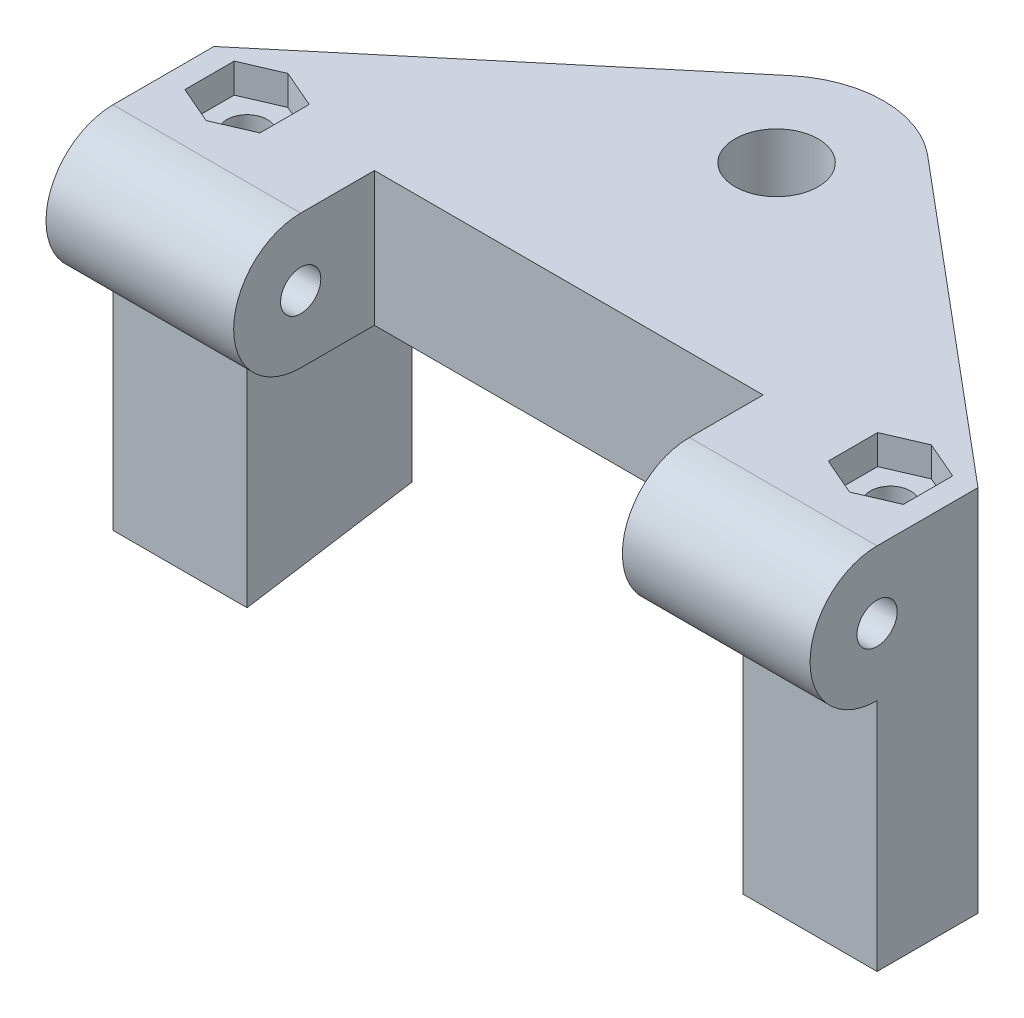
ISO-10303-21;
HEADER;
FILE_DESCRIPTION(('STEP AP214'),'2;1');
FILE_NAME('part.step','',(''),(''),'','','');
FILE_SCHEMA(('AUTOMOTIVE_DESIGN { 1 0 10303 214 1 1 1 1 }'));
ENDSEC;
DATA;
#1=APPLICATION_CONTEXT('core data for automotive mechanical design processes');
#2=APPLICATION_PROTOCOL_DEFINITION('international standard','automotive_design',2000,#1);
#3=PRODUCT_CONTEXT('',#1,'mechanical');
#4=PRODUCT('Part','Part','',(#3));
#5=PRODUCT_RELATED_PRODUCT_CATEGORY('part','',(#4));
#6=PRODUCT_DEFINITION_FORMATION('','',#4);
#7=PRODUCT_DEFINITION_CONTEXT('part definition',#1,'design');
#8=PRODUCT_DEFINITION('design','',#6,#7);
#9=PRODUCT_DEFINITION_SHAPE('','',#8);
#10=(LENGTH_UNIT() NAMED_UNIT(*) SI_UNIT(.MILLI.,.METRE.));
#11=(NAMED_UNIT(*) PLANE_ANGLE_UNIT() SI_UNIT($,.RADIAN.));
#12=(NAMED_UNIT(*) SI_UNIT($,.STERADIAN.) SOLID_ANGLE_UNIT());
#13=UNCERTAINTY_MEASURE_WITH_UNIT(LENGTH_MEASURE(1.E-05),#10,'distance_accuracy_value','');
#14=(GEOMETRIC_REPRESENTATION_CONTEXT(3) GLOBAL_UNCERTAINTY_ASSIGNED_CONTEXT((#13)) GLOBAL_UNIT_ASSIGNED_CONTEXT((#10,
#11,#12)) REPRESENTATION_CONTEXT('',''));
#15=CARTESIAN_POINT('',(0.,0.,0.));
#16=DIRECTION('',(0.,0.,1.));
#17=DIRECTION('',(1.,0.,0.));
#18=AXIS2_PLACEMENT_3D('',#15,#16,#17);
#19=CARTESIAN_POINT('',(26.0755319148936,-11.9595744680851,9.));
#20=DIRECTION('',(0.,1.,0.));
#21=DIRECTION('',(-1.,0.,0.));
#22=AXIS2_PLACEMENT_3D('',#19,#20,#21);
#23=CYLINDRICAL_SURFACE('',#22,1.49999999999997);
#24=CARTESIAN_POINT('',(26.0755319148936,-11.9595744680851,9.));
#25=DIRECTION('',(0.,-1.,0.));
#26=DIRECTION('',(1.,0.,0.));
#27=AXIS2_PLACEMENT_3D('',#24,#25,#26);
#28=CIRCLE('',#27,1.49999999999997);
#29=CARTESIAN_POINT('',(27.5755319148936,-11.9595744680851,9.));
#30=VERTEX_POINT('',#29);
#31=EDGE_CURVE('E268',#30,#30,#28,.T.);
#32=ORIENTED_EDGE('',*,*,#31,.T.);
#33=EDGE_LOOP('',(#32));
#34=FACE_BOUND('',#33,.T.);
#35=CARTESIAN_POINT('',(26.0755319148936,13.3404255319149,9.));
#36=DIRECTION('',(0.,-1.,0.));
#37=DIRECTION('',(1.,0.,0.));
#38=AXIS2_PLACEMENT_3D('',#35,#36,#37);
#39=CIRCLE('',#38,1.49999999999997);
#40=CARTESIAN_POINT('',(27.5755319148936,13.3404255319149,9.));
#41=VERTEX_POINT('',#40);
#42=EDGE_CURVE('E239',#41,#41,#39,.T.);
#43=ORIENTED_EDGE('',*,*,#42,.F.);
#44=EDGE_LOOP('',(#43));
#45=FACE_BOUND('',#44,.T.);
#46=ADVANCED_FACE('F39',(#34,#45),#23,.F.);
#47=CARTESIAN_POINT('',(-26.4244680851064,15.5404255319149,9.));
#48=DIRECTION('',(0.,-1.,0.));
#49=DIRECTION('',(1.,0.,0.));
#50=AXIS2_PLACEMENT_3D('',#47,#48,#49);
#51=PLANE('',#50);
#52=DIRECTION('',(-0.918032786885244,0.,0.396504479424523));
#53=VECTOR('',#52,1.);
#54=CARTESIAN_POINT('',(9.76376113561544,15.5404255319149,12.9951625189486));
#55=LINE('',#54,#53);
#56=CARTESIAN_POINT('',(26.0755319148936,15.5404255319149,5.95000000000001));
#57=VERTEX_POINT('',#56);
#58=CARTESIAN_POINT('',(23.2755319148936,15.5404255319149,7.1593386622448));
#59=VERTEX_POINT('',#58);
#60=EDGE_CURVE('E253',#57,#59,#55,.T.);
#61=ORIENTED_EDGE('',*,*,#60,.F.);
#62=DIRECTION('',(-0.918032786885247,0.,-0.396504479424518));
#63=VECTOR('',#62,1.);
#64=CARTESIAN_POINT('',(5.43211219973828,15.5404255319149,-2.96603056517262));
#65=LINE('',#64,#63);
#66=CARTESIAN_POINT('',(28.8755319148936,15.5404255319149,7.15933866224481));
#67=VERTEX_POINT('',#66);
#68=EDGE_CURVE('E54',#67,#57,#65,.T.);
#69=ORIENTED_EDGE('',*,*,#68,.F.);
#70=DIRECTION('',(0.,0.,1.));
#71=VECTOR('',#70,1.);
#72=CARTESIAN_POINT('',(28.8755319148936,15.5404255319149,0.));
#73=LINE('',#72,#71);
#74=CARTESIAN_POINT('',(28.8755319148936,15.5404255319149,10.8406613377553));
#75=VERTEX_POINT('',#74);
#76=EDGE_CURVE('E242',#67,#75,#73,.T.);
#77=ORIENTED_EDGE('',*,*,#76,.T.);
#78=DIRECTION('',(-0.918032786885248,0.,0.396504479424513));
#79=VECTOR('',#78,1.);
#80=CARTESIAN_POINT('',(11.9841862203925,15.5404255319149,18.1361461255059));
#81=LINE('',#80,#79);
#82=CARTESIAN_POINT('',(26.0755319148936,15.5404255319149,12.0500000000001));
#83=VERTEX_POINT('',#82);
#84=EDGE_CURVE('E261',#75,#83,#81,.T.);
#85=ORIENTED_EDGE('',*,*,#84,.T.);
#86=DIRECTION('',(-0.918032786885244,0.,-0.396504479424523));
#87=VECTOR('',#86,1.);
#88=CARTESIAN_POINT('',(3.21168711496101,15.5404255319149,2.17495304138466));
#89=LINE('',#88,#87);
#90=CARTESIAN_POINT('',(23.2755319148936,15.5404255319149,10.8406613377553));
#91=VERTEX_POINT('',#90);
#92=EDGE_CURVE('E258',#83,#91,#89,.T.);
#93=ORIENTED_EDGE('',*,*,#92,.T.);
#94=DIRECTION('',(0.,0.,1.));
#95=VECTOR('',#94,1.);
#96=CARTESIAN_POINT('',(23.2755319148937,15.5404255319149,1.44190191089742E-13));
#97=LINE('',#96,#95);
#98=EDGE_CURVE('E255',#59,#91,#97,.T.);
#99=ORIENTED_EDGE('',*,*,#98,.F.);
#100=EDGE_LOOP('',(#61,#69,#77,#85,#93,#99));
#101=FACE_BOUND('',#100,.T.);
#102=DIRECTION('',(0.,0.,-1.));
#103=VECTOR('',#102,1.);
#104=CARTESIAN_POINT('',(30.5755319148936,15.5404255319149,9.));
#105=LINE('',#104,#103);
#106=CARTESIAN_POINT('',(30.5755319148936,15.5404255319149,14.5));
#107=VERTEX_POINT('',#106);
#108=CARTESIAN_POINT('',(30.5755319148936,15.5404255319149,6.97108117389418));
#109=VERTEX_POINT('',#108);
#110=EDGE_CURVE('E381',#107,#109,#105,.T.);
#111=ORIENTED_EDGE('',*,*,#110,.T.);
#112=DIRECTION('',(0.766044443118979,0.,0.642787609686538));
#113=VECTOR('',#112,1.);
#114=CARTESIAN_POINT('',(9.20048586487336,15.5404255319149,-10.9647120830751));
#115=LINE('',#114,#113);
#116=CARTESIAN_POINT('',(7.21783279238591,15.5404255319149,-12.6283555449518));
#117=VERTEX_POINT('',#116);
#118=EDGE_CURVE('E353',#117,#109,#115,.T.);
#119=ORIENTED_EDGE('',*,*,#118,.F.);
#120=CARTESIAN_POINT('',(2.07553191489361,15.5404255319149,-6.49999999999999));
#121=DIRECTION('',(0.,1.,0.));
#122=DIRECTION('',(-1.,0.,0.));
#123=AXIS2_PLACEMENT_3D('',#120,#121,#122);
#124=CIRCLE('',#123,8.);
#125=CARTESIAN_POINT('',(-3.0667689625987,15.5404255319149,-12.6283555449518));
#126=VERTEX_POINT('',#125);
#127=EDGE_CURVE('E370',#117,#126,#124,.T.);
#128=ORIENTED_EDGE('',*,*,#127,.T.);
#129=DIRECTION('',(-0.766044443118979,0.,0.642787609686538));
#130=VECTOR('',#129,1.);
#131=CARTESIAN_POINT('',(-7.48536628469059,15.5404255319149,-8.92071216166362));
#132=LINE('',#131,#130);
#133=CARTESIAN_POINT('',(-26.4244680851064,15.5404255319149,6.97108117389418));
#134=VERTEX_POINT('',#133);
#135=EDGE_CURVE('E373',#126,#134,#132,.T.);
#136=ORIENTED_EDGE('',*,*,#135,.T.);
#137=DIRECTION('',(0.,0.,-1.));
#138=VECTOR('',#137,1.);
#139=CARTESIAN_POINT('',(-26.4244680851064,15.5404255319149,9.));
#140=LINE('',#139,#138);
#141=CARTESIAN_POINT('',(-26.4244680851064,15.5404255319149,14.5));
#142=VERTEX_POINT('',#141);
#143=EDGE_CURVE('E386',#142,#134,#140,.T.);
#144=ORIENTED_EDGE('',*,*,#143,.F.);
#145=DIRECTION('',(-1.,0.,0.));
#146=VECTOR('',#145,1.);
#147=CARTESIAN_POINT('',(-12.4244680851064,15.5404255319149,14.5));
#148=LINE('',#147,#146);
#149=CARTESIAN_POINT('',(-12.4244680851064,15.5404255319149,14.5));
#150=VERTEX_POINT('',#149);
#151=EDGE_CURVE('E401',#150,#142,#148,.T.);
#152=ORIENTED_EDGE('',*,*,#151,.F.);
#153=DIRECTION('',(0.,0.,1.));
#154=VECTOR('',#153,1.);
#155=CARTESIAN_POINT('',(-12.4244680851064,15.5404255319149,0.));
#156=LINE('',#155,#154);
#157=CARTESIAN_POINT('',(-12.4244680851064,15.5404255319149,9.));
#158=VERTEX_POINT('',#157);
#159=EDGE_CURVE('E415',#158,#150,#156,.T.);
#160=ORIENTED_EDGE('',*,*,#159,.F.);
#161=DIRECTION('',(-1.,0.,0.));
#162=VECTOR('',#161,1.);
#163=CARTESIAN_POINT('',(-26.4244680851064,15.5404255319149,9.));
#164=LINE('',#163,#162);
#165=CARTESIAN_POINT('',(16.5755319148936,15.5404255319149,9.));
#166=VERTEX_POINT('',#165);
#167=EDGE_CURVE('E390',#166,#158,#164,.T.);
#168=ORIENTED_EDGE('',*,*,#167,.F.);
#169=DIRECTION('',(0.,0.,1.));
#170=VECTOR('',#169,1.);
#171=CARTESIAN_POINT('',(16.5755319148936,15.5404255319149,0.));
#172=LINE('',#171,#170);
#173=CARTESIAN_POINT('',(16.5755319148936,15.5404255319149,14.5));
#174=VERTEX_POINT('',#173);
#175=EDGE_CURVE('E392',#166,#174,#172,.T.);
#176=ORIENTED_EDGE('',*,*,#175,.T.);
#177=DIRECTION('',(1.,0.,0.));
#178=VECTOR('',#177,1.);
#179=CARTESIAN_POINT('',(16.5755319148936,15.5404255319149,14.5));
#180=LINE('',#179,#178);
#181=EDGE_CURVE('E385',#174,#107,#180,.T.);
#182=ORIENTED_EDGE('',*,*,#181,.T.);
#183=EDGE_LOOP('',(#111,#119,#128,#136,#144,#152,#160,#168,#176,#182));
#184=FACE_BOUND('',#183,.T.);
#185=CARTESIAN_POINT('',(2.07553191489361,15.5404255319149,-6.49999999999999));
#186=DIRECTION('',(0.,1.,0.));
#187=DIRECTION('',(-1.,0.,0.));
#188=AXIS2_PLACEMENT_3D('',#185,#186,#187);
#189=CIRCLE('',#188,3.1);
#190=CARTESIAN_POINT('',(-1.02446808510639,15.5404255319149,-6.49999999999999));
#191=VERTEX_POINT('',#190);
#192=EDGE_CURVE('E360',#191,#191,#189,.T.);
#193=ORIENTED_EDGE('',*,*,#192,.F.);
#194=EDGE_LOOP('',(#193));
#195=FACE_BOUND('',#194,.T.);
#196=DIRECTION('',(0.918032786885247,0.,-0.396504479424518));
#197=VECTOR('',#196,1.);
#198=CARTESIAN_POINT('',(-1.28104836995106,15.5404255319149,-2.96603056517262));
#199=LINE('',#198,#197);
#200=CARTESIAN_POINT('',(-24.7244680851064,15.5404255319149,7.15933866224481));
#201=VERTEX_POINT('',#200);
#202=CARTESIAN_POINT('',(-21.9244680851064,15.5404255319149,5.95000000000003));
#203=VERTEX_POINT('',#202);
#204=EDGE_CURVE('E62',#201,#203,#199,.T.);
#205=ORIENTED_EDGE('',*,*,#204,.T.);
#206=DIRECTION('',(0.918032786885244,0.,0.396504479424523));
#207=VECTOR('',#206,1.);
#208=CARTESIAN_POINT('',(-5.61269730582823,15.5404255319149,12.9951625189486));
#209=LINE('',#208,#207);
#210=CARTESIAN_POINT('',(-19.1244680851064,15.5404255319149,7.1593386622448));
#211=VERTEX_POINT('',#210);
#212=EDGE_CURVE('E284',#203,#211,#209,.T.);
#213=ORIENTED_EDGE('',*,*,#212,.T.);
#214=DIRECTION('',(0.,0.,1.));
#215=VECTOR('',#214,1.);
#216=CARTESIAN_POINT('',(-19.1244680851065,15.5404255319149,1.44190191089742E-13));
#217=LINE('',#216,#215);
#218=CARTESIAN_POINT('',(-19.1244680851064,15.5404255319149,10.8406613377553));
#219=VERTEX_POINT('',#218);
#220=EDGE_CURVE('E311',#211,#219,#217,.T.);
#221=ORIENTED_EDGE('',*,*,#220,.T.);
#222=DIRECTION('',(0.918032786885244,0.,-0.396504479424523));
#223=VECTOR('',#222,1.);
#224=CARTESIAN_POINT('',(0.939376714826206,15.5404255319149,2.17495304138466));
#225=LINE('',#224,#223);
#226=CARTESIAN_POINT('',(-21.9244680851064,15.5404255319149,12.0500000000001));
#227=VERTEX_POINT('',#226);
#228=EDGE_CURVE('E308',#227,#219,#225,.T.);
#229=ORIENTED_EDGE('',*,*,#228,.F.);
#230=DIRECTION('',(0.918032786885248,0.,0.396504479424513));
#231=VECTOR('',#230,1.);
#232=CARTESIAN_POINT('',(-7.83312239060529,15.5404255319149,18.1361461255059));
#233=LINE('',#232,#231);
#234=CARTESIAN_POINT('',(-24.7244680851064,15.5404255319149,10.8406613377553));
#235=VERTEX_POINT('',#234);
#236=EDGE_CURVE('E305',#235,#227,#233,.T.);
#237=ORIENTED_EDGE('',*,*,#236,.F.);
#238=DIRECTION('',(0.,0.,1.));
#239=VECTOR('',#238,1.);
#240=CARTESIAN_POINT('',(-24.7244680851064,15.5404255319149,0.));
#241=LINE('',#240,#239);
#242=EDGE_CURVE('E302',#201,#235,#241,.T.);
#243=ORIENTED_EDGE('',*,*,#242,.F.);
#244=EDGE_LOOP('',(#205,#213,#221,#229,#237,#243));
#245=FACE_BOUND('',#244,.T.);
#246=ADVANCED_FACE('F494',(#101,#184,#195,#245),#51,.F.);
#247=CARTESIAN_POINT('',(-21.9244680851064,-11.9595744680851,9.));
#248=DIRECTION('',(0.,1.,0.));
#249=DIRECTION('',(-1.,0.,0.));
#250=AXIS2_PLACEMENT_3D('',#247,#248,#249);
#251=CYLINDRICAL_SURFACE('',#250,1.49999999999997);
#252=CARTESIAN_POINT('',(-21.9244680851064,-11.9595744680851,9.));
#253=DIRECTION('',(0.,1.,0.));
#254=DIRECTION('',(-1.,0.,0.));
#255=AXIS2_PLACEMENT_3D('',#252,#253,#254);
#256=CIRCLE('',#255,1.49999999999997);
#257=CARTESIAN_POINT('',(-23.4244680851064,-11.9595744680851,9.));
#258=VERTEX_POINT('',#257);
#259=EDGE_CURVE('E318',#258,#258,#256,.T.);
#260=ORIENTED_EDGE('',*,*,#259,.F.);
#261=EDGE_LOOP('',(#260));
#262=FACE_BOUND('',#261,.T.);
#263=CARTESIAN_POINT('',(-21.9244680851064,13.3404255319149,9.));
#264=DIRECTION('',(0.,1.,0.));
#265=DIRECTION('',(-1.,0.,0.));
#266=AXIS2_PLACEMENT_3D('',#263,#264,#265);
#267=CIRCLE('',#266,1.49999999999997);
#268=CARTESIAN_POINT('',(-23.4244680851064,13.3404255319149,9.));
#269=VERTEX_POINT('',#268);
#270=EDGE_CURVE('E280',#269,#269,#267,.T.);
#271=ORIENTED_EDGE('',*,*,#270,.T.);
#272=EDGE_LOOP('',(#271));
#273=FACE_BOUND('',#272,.T.);
#274=ADVANCED_FACE('F554',(#262,#273),#251,.F.);
#275=CARTESIAN_POINT('',(0.,-11.9595744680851,0.));
#276=DIRECTION('',(0.,-1.,0.));
#277=DIRECTION('',(0.,0.,-1.));
#278=AXIS2_PLACEMENT_3D('',#275,#276,#277);
#279=PLANE('',#278);
#280=ORIENTED_EDGE('',*,*,#259,.T.);
#281=EDGE_LOOP('',(#280));
#282=FACE_BOUND('',#281,.T.);
#283=DIRECTION('',(-0.766044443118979,0.,0.642787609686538));
#284=VECTOR('',#283,1.);
#285=CARTESIAN_POINT('',(-7.48536628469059,-11.9595744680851,-8.92071216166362));
#286=LINE('',#285,#284);
#287=CARTESIAN_POINT('',(-18.3925381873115,-11.9595744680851,0.231491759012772));
#288=VERTEX_POINT('',#287);
#289=CARTESIAN_POINT('',(-26.4244680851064,-11.9595744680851,6.97108117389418));
#290=VERTEX_POINT('',#289);
#291=EDGE_CURVE('E333',#288,#290,#286,.T.);
#292=ORIENTED_EDGE('',*,*,#291,.F.);
#293=DIRECTION('',(0.136637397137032,0.,0.990621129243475));
#294=VECTOR('',#293,1.);
#295=CARTESIAN_POINT('',(-18.0804873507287,-11.9595744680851,2.49386032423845));
#296=LINE('',#295,#294);
#297=CARTESIAN_POINT('',(-16.4244680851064,-11.9595744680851,14.5));
#298=VERTEX_POINT('',#297);
#299=EDGE_CURVE('E330',#288,#298,#296,.T.);
#300=ORIENTED_EDGE('',*,*,#299,.T.);
#301=DIRECTION('',(-1.,0.,0.));
#302=VECTOR('',#301,1.);
#303=CARTESIAN_POINT('',(-12.4244680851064,-11.9595744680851,14.5));
#304=LINE('',#303,#302);
#305=CARTESIAN_POINT('',(-26.4244680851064,-11.9595744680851,14.5));
#306=VERTEX_POINT('',#305);
#307=EDGE_CURVE('E47',#298,#306,#304,.T.);
#308=ORIENTED_EDGE('',*,*,#307,.T.);
#309=DIRECTION('',(0.,0.,-1.));
#310=VECTOR('',#309,1.);
#311=CARTESIAN_POINT('',(-26.4244680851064,-11.9595744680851,14.5));
#312=LINE('',#311,#310);
#313=EDGE_CURVE('E11',#306,#290,#312,.T.);
#314=ORIENTED_EDGE('',*,*,#313,.T.);
#315=EDGE_LOOP('',(#292,#300,#308,#314));
#316=FACE_BOUND('',#315,.T.);
#317=ADVANCED_FACE('F526',(#282,#316),#279,.T.);
#318=ORIENTED_EDGE('',*,*,#31,.F.);
#319=EDGE_LOOP('',(#318));
#320=FACE_BOUND('',#319,.T.);
#321=DIRECTION('',(-1.,0.,0.));
#322=VECTOR('',#321,1.);
#323=CARTESIAN_POINT('',(30.5755319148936,-11.9595744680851,14.5));
#324=LINE('',#323,#322);
#325=CARTESIAN_POINT('',(30.5755319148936,-11.9595744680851,14.5));
#326=VERTEX_POINT('',#325);
#327=CARTESIAN_POINT('',(20.5755319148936,-11.9595744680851,14.5));
#328=VERTEX_POINT('',#327);
#329=EDGE_CURVE('E460',#326,#328,#324,.T.);
#330=ORIENTED_EDGE('',*,*,#329,.T.);
#331=DIRECTION('',(0.136637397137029,0.,-0.990621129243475));
#332=VECTOR('',#331,1.);
#333=CARTESIAN_POINT('',(22.1540517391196,-11.9595744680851,3.05573127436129));
#334=LINE('',#333,#332);
#335=CARTESIAN_POINT('',(22.5436020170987,-11.9595744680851,0.231491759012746));
#336=VERTEX_POINT('',#335);
#337=EDGE_CURVE('E335',#328,#336,#334,.T.);
#338=ORIENTED_EDGE('',*,*,#337,.T.);
#339=DIRECTION('',(0.766044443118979,0.,0.642787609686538));
#340=VECTOR('',#339,1.);
#341=CARTESIAN_POINT('',(9.20048586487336,-11.9595744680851,-10.9647120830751));
#342=LINE('',#341,#340);
#343=CARTESIAN_POINT('',(30.5755319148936,-11.9595744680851,6.97108117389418));
#344=VERTEX_POINT('',#343);
#345=EDGE_CURVE('E347',#336,#344,#342,.T.);
#346=ORIENTED_EDGE('',*,*,#345,.T.);
#347=DIRECTION('',(0.,0.,1.));
#348=VECTOR('',#347,1.);
#349=CARTESIAN_POINT('',(30.5755319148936,-11.9595744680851,0.));
#350=LINE('',#349,#348);
#351=EDGE_CURVE('E440',#344,#326,#350,.T.);
#352=ORIENTED_EDGE('',*,*,#351,.T.);
#353=EDGE_LOOP('',(#330,#338,#346,#352));
#354=FACE_BOUND('',#353,.T.);
#355=ADVANCED_FACE('F465',(#320,#354),#279,.T.);
#356=CARTESIAN_POINT('',(9.20048586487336,5.54042553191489,-10.9647120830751));
#357=DIRECTION('',(-0.642787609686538,0.,0.766044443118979));
#358=DIRECTION('',(0.766044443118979,0.,0.642787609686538));
#359=AXIS2_PLACEMENT_3D('',#356,#357,#358);
#360=PLANE('',#359);
#361=DIRECTION('',(0.,-1.,0.));
#362=VECTOR('',#361,1.);
#363=CARTESIAN_POINT('',(22.5436020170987,20.1733780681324,0.231491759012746));
#364=LINE('',#363,#362);
#365=CARTESIAN_POINT('',(22.5436020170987,5.54042553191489,0.231491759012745));
#366=VERTEX_POINT('',#365);
#367=EDGE_CURVE('E334',#366,#336,#364,.T.);
#368=ORIENTED_EDGE('',*,*,#367,.F.);
#369=DIRECTION('',(0.766044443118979,0.,0.642787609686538));
#370=VECTOR('',#369,1.);
#371=CARTESIAN_POINT('',(9.20048586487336,5.54042553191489,-10.9647120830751));
#372=LINE('',#371,#370);
#373=CARTESIAN_POINT('',(7.21783279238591,5.54042553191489,-12.6283555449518));
#374=VERTEX_POINT('',#373);
#375=EDGE_CURVE('E357',#374,#366,#372,.T.);
#376=ORIENTED_EDGE('',*,*,#375,.F.);
#377=DIRECTION('',(0.,1.,0.));
#378=VECTOR('',#377,1.);
#379=CARTESIAN_POINT('',(7.21783279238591,5.54042553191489,-12.6283555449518));
#380=LINE('',#379,#378);
#381=EDGE_CURVE('E368',#374,#117,#380,.T.);
#382=ORIENTED_EDGE('',*,*,#381,.T.);
#383=ORIENTED_EDGE('',*,*,#118,.T.);
#384=DIRECTION('',(0.,1.,0.));
#385=VECTOR('',#384,1.);
#386=CARTESIAN_POINT('',(30.5755319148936,-11.9595744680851,6.97108117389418));
#387=LINE('',#386,#385);
#388=EDGE_CURVE('E349',#344,#109,#387,.T.);
#389=ORIENTED_EDGE('',*,*,#388,.F.);
#390=ORIENTED_EDGE('',*,*,#345,.F.);
#391=EDGE_LOOP('',(#368,#376,#382,#383,#389,#390));
#392=FACE_BOUND('',#391,.T.);
#393=ADVANCED_FACE('F491',(#392),#360,.F.);
#394=CARTESIAN_POINT('',(-7.48536628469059,5.54042553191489,-8.92071216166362));
#395=DIRECTION('',(-0.642787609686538,0.,-0.766044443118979));
#396=DIRECTION('',(-0.766044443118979,0.,0.642787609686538));
#397=AXIS2_PLACEMENT_3D('',#394,#395,#396);
#398=PLANE('',#397);
#399=DIRECTION('',(-0.766044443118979,0.,0.642787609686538));
#400=VECTOR('',#399,1.);
#401=CARTESIAN_POINT('',(-7.48536628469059,5.54042553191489,-8.92071216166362));
#402=LINE('',#401,#400);
#403=CARTESIAN_POINT('',(-3.0667689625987,5.54042553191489,-12.6283555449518));
#404=VERTEX_POINT('',#403);
#405=CARTESIAN_POINT('',(-18.3925381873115,5.54042553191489,0.231491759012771));
#406=VERTEX_POINT('',#405);
#407=EDGE_CURVE('E363',#404,#406,#402,.T.);
#408=ORIENTED_EDGE('',*,*,#407,.T.);
#409=DIRECTION('',(0.,-1.,0.));
#410=VECTOR('',#409,1.);
#411=CARTESIAN_POINT('',(-18.3925381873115,20.1733780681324,0.231491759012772));
#412=LINE('',#411,#410);
#413=EDGE_CURVE('E342',#406,#288,#412,.T.);
#414=ORIENTED_EDGE('',*,*,#413,.T.);
#415=ORIENTED_EDGE('',*,*,#291,.T.);
#416=DIRECTION('',(0.,1.,0.));
#417=VECTOR('',#416,1.);
#418=CARTESIAN_POINT('',(-26.4244680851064,-11.9595744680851,6.97108117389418));
#419=LINE('',#418,#417);
#420=EDGE_CURVE('E350',#290,#134,#419,.T.);
#421=ORIENTED_EDGE('',*,*,#420,.T.);
#422=ORIENTED_EDGE('',*,*,#135,.F.);
#423=DIRECTION('',(0.,1.,0.));
#424=VECTOR('',#423,1.);
#425=CARTESIAN_POINT('',(-3.0667689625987,5.54042553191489,-12.6283555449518));
#426=LINE('',#425,#424);
#427=EDGE_CURVE('E377',#404,#126,#426,.T.);
#428=ORIENTED_EDGE('',*,*,#427,.F.);
#429=EDGE_LOOP('',(#408,#414,#415,#421,#422,#428));
#430=FACE_BOUND('',#429,.T.);
#431=ADVANCED_FACE('F532',(#430),#398,.T.);
#432=CARTESIAN_POINT('',(-26.4244680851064,15.5404255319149,9.));
#433=DIRECTION('',(1.,0.,0.));
#434=DIRECTION('',(0.,1.,0.));
#435=AXIS2_PLACEMENT_3D('',#432,#433,#434);
#436=PLANE('',#435);
#437=CARTESIAN_POINT('',(-26.4244680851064,10.5404255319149,14.5));
#438=DIRECTION('',(-1.,0.,0.));
#439=DIRECTION('',(0.,-1.,0.));
#440=AXIS2_PLACEMENT_3D('',#437,#438,#439);
#441=CIRCLE('',#440,1.5);
#442=CARTESIAN_POINT('',(-26.4244680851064,9.04042553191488,14.5));
#443=VERTEX_POINT('',#442);
#444=EDGE_CURVE('E404',#443,#443,#441,.T.);
#445=ORIENTED_EDGE('',*,*,#444,.F.);
#446=EDGE_LOOP('',(#445));
#447=FACE_BOUND('',#446,.T.);
#448=ORIENTED_EDGE('',*,*,#420,.F.);
#449=ORIENTED_EDGE('',*,*,#313,.F.);
#450=DIRECTION('',(0.,-1.,0.));
#451=VECTOR('',#450,1.);
#452=CARTESIAN_POINT('',(-26.4244680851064,16.9531377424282,14.5));
#453=LINE('',#452,#451);
#454=CARTESIAN_POINT('',(-26.4244680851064,5.54042553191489,14.5));
#455=VERTEX_POINT('',#454);
#456=EDGE_CURVE('E447',#455,#306,#453,.T.);
#457=ORIENTED_EDGE('',*,*,#456,.F.);
#458=CARTESIAN_POINT('',(-26.4244680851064,10.5404255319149,14.5));
#459=DIRECTION('',(-1.,0.,0.));
#460=DIRECTION('',(0.,-1.,0.));
#461=AXIS2_PLACEMENT_3D('',#458,#459,#460);
#462=CIRCLE('',#461,5.);
#463=EDGE_CURVE('E379',#455,#142,#462,.T.);
#464=ORIENTED_EDGE('',*,*,#463,.T.);
#465=ORIENTED_EDGE('',*,*,#143,.T.);
#466=EDGE_LOOP('',(#448,#449,#457,#464,#465));
#467=FACE_BOUND('',#466,.T.);
#468=ADVANCED_FACE('F529',(#447,#467),#436,.F.);
#469=CARTESIAN_POINT('',(30.5755319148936,15.5404255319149,9.));
#470=DIRECTION('',(-1.,0.,0.));
#471=DIRECTION('',(0.,-1.,0.));
#472=AXIS2_PLACEMENT_3D('',#469,#470,#471);
#473=PLANE('',#472);
#474=CARTESIAN_POINT('',(30.5755319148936,10.5404255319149,14.5));
#475=DIRECTION('',(-1.,0.,0.));
#476=DIRECTION('',(0.,-1.,0.));
#477=AXIS2_PLACEMENT_3D('',#474,#475,#476);
#478=CIRCLE('',#477,1.5);
#479=CARTESIAN_POINT('',(30.5755319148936,9.04042553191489,14.5));
#480=VERTEX_POINT('',#479);
#481=EDGE_CURVE('E389',#480,#480,#478,.T.);
#482=ORIENTED_EDGE('',*,*,#481,.T.);
#483=EDGE_LOOP('',(#482));
#484=FACE_BOUND('',#483,.T.);
#485=ORIENTED_EDGE('',*,*,#351,.F.);
#486=ORIENTED_EDGE('',*,*,#388,.T.);
#487=ORIENTED_EDGE('',*,*,#110,.F.);
#488=CARTESIAN_POINT('',(30.5755319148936,10.5404255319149,14.5));
#489=DIRECTION('',(-1.,0.,0.));
#490=DIRECTION('',(0.,-1.,0.));
#491=AXIS2_PLACEMENT_3D('',#488,#489,#490);
#492=CIRCLE('',#491,5.);
#493=CARTESIAN_POINT('',(30.5755319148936,5.54042553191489,14.5));
#494=VERTEX_POINT('',#493);
#495=EDGE_CURVE('E414',#494,#107,#492,.T.);
#496=ORIENTED_EDGE('',*,*,#495,.F.);
#497=DIRECTION('',(0.,-1.,0.));
#498=VECTOR('',#497,1.);
#499=CARTESIAN_POINT('',(30.5755319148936,16.9531377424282,14.5));
#500=LINE('',#499,#498);
#501=EDGE_CURVE('E431',#494,#326,#500,.T.);
#502=ORIENTED_EDGE('',*,*,#501,.T.);
#503=EDGE_LOOP('',(#485,#486,#487,#496,#502));
#504=FACE_BOUND('',#503,.T.);
#505=ADVANCED_FACE('F41',(#484,#504),#473,.F.);
#506=CARTESIAN_POINT('',(0.,16.9531377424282,14.5));
#507=DIRECTION('',(0.,0.,1.));
#508=DIRECTION('',(1.,0.,0.));
#509=AXIS2_PLACEMENT_3D('',#506,#507,#508);
#510=PLANE('',#509);
#511=ORIENTED_EDGE('',*,*,#456,.T.);
#512=ORIENTED_EDGE('',*,*,#307,.F.);
#513=DIRECTION('',(0.,-1.,0.));
#514=VECTOR('',#513,1.);
#515=CARTESIAN_POINT('',(-16.4244680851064,16.9531377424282,14.5));
#516=LINE('',#515,#514);
#517=CARTESIAN_POINT('',(-16.4244680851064,5.54042553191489,14.5));
#518=VERTEX_POINT('',#517);
#519=EDGE_CURVE('E450',#518,#298,#516,.T.);
#520=ORIENTED_EDGE('',*,*,#519,.F.);
#521=DIRECTION('',(1.,0.,0.));
#522=VECTOR('',#521,1.);
#523=CARTESIAN_POINT('',(0.,5.54042553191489,14.5));
#524=LINE('',#523,#522);
#525=EDGE_CURVE('E384',#455,#518,#524,.T.);
#526=ORIENTED_EDGE('',*,*,#525,.F.);
#527=EDGE_LOOP('',(#511,#512,#520,#526));
#528=FACE_BOUND('',#527,.T.);
#529=ADVANCED_FACE('F521',(#528),#510,.T.);
#530=CARTESIAN_POINT('',(30.5755319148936,16.9531377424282,14.5));
#531=DIRECTION('',(0.,0.,1.));
#532=DIRECTION('',(1.,0.,0.));
#533=AXIS2_PLACEMENT_3D('',#530,#531,#532);
#534=PLANE('',#533);
#535=DIRECTION('',(0.,-1.,0.));
#536=VECTOR('',#535,1.);
#537=CARTESIAN_POINT('',(20.5755319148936,16.9531377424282,14.5));
#538=LINE('',#537,#536);
#539=CARTESIAN_POINT('',(20.5755319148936,5.54042553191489,14.5));
#540=VERTEX_POINT('',#539);
#541=EDGE_CURVE('E397',#540,#328,#538,.T.);
#542=ORIENTED_EDGE('',*,*,#541,.T.);
#543=ORIENTED_EDGE('',*,*,#329,.F.);
#544=ORIENTED_EDGE('',*,*,#501,.F.);
#545=DIRECTION('',(1.,0.,0.));
#546=VECTOR('',#545,1.);
#547=CARTESIAN_POINT('',(30.5755319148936,5.54042553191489,14.5));
#548=LINE('',#547,#546);
#549=EDGE_CURVE('E428',#540,#494,#548,.T.);
#550=ORIENTED_EDGE('',*,*,#549,.F.);
#551=EDGE_LOOP('',(#542,#543,#544,#550));
#552=FACE_BOUND('',#551,.T.);
#553=ADVANCED_FACE('F471',(#552),#534,.T.);
#554=CARTESIAN_POINT('',(-16.4244680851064,5.54042553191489,9.));
#555=DIRECTION('',(0.,-1.,0.));
#556=DIRECTION('',(0.,0.,-1.));
#557=AXIS2_PLACEMENT_3D('',#554,#555,#556);
#558=PLANE('',#557);
#559=DIRECTION('',(-0.136637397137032,0.,-0.990621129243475));
#560=VECTOR('',#559,1.);
#561=CARTESIAN_POINT('',(-18.0804873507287,5.54042553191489,2.49386032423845));
#562=LINE('',#561,#560);
#563=EDGE_CURVE('E338',#518,#406,#562,.T.);
#564=ORIENTED_EDGE('',*,*,#563,.T.);
#565=ORIENTED_EDGE('',*,*,#407,.F.);
#566=CARTESIAN_POINT('',(2.07553191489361,5.54042553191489,-6.49999999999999));
#567=DIRECTION('',(0.,1.,0.));
#568=DIRECTION('',(-1.,0.,0.));
#569=AXIS2_PLACEMENT_3D('',#566,#567,#568);
#570=CIRCLE('',#569,8.);
#571=EDGE_CURVE('E359',#374,#404,#570,.T.);
#572=ORIENTED_EDGE('',*,*,#571,.F.);
#573=ORIENTED_EDGE('',*,*,#375,.T.);
#574=DIRECTION('',(-0.136637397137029,0.,0.990621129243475));
#575=VECTOR('',#574,1.);
#576=CARTESIAN_POINT('',(22.1540517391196,5.54042553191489,3.05573127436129));
#577=LINE('',#576,#575);
#578=EDGE_CURVE('E331',#366,#540,#577,.T.);
#579=ORIENTED_EDGE('',*,*,#578,.T.);
#580=DIRECTION('',(1.,0.,0.));
#581=VECTOR('',#580,1.);
#582=CARTESIAN_POINT('',(16.5755319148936,5.54042553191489,14.5));
#583=LINE('',#582,#581);
#584=CARTESIAN_POINT('',(16.5755319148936,5.54042553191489,14.5));
#585=VERTEX_POINT('',#584);
#586=EDGE_CURVE('E425',#585,#540,#583,.T.);
#587=ORIENTED_EDGE('',*,*,#586,.F.);
#588=DIRECTION('',(0.,0.,1.));
#589=VECTOR('',#588,1.);
#590=CARTESIAN_POINT('',(16.5755319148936,5.54042553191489,0.));
#591=LINE('',#590,#589);
#592=CARTESIAN_POINT('',(16.5755319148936,5.54042553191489,9.));
#593=VERTEX_POINT('',#592);
#594=EDGE_CURVE('E437',#593,#585,#591,.T.);
#595=ORIENTED_EDGE('',*,*,#594,.F.);
#596=DIRECTION('',(-1.,0.,0.));
#597=VECTOR('',#596,1.);
#598=CARTESIAN_POINT('',(-16.4244680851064,5.54042553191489,9.));
#599=LINE('',#598,#597);
#600=CARTESIAN_POINT('',(-12.4244680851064,5.54042553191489,9.));
#601=VERTEX_POINT('',#600);
#602=EDGE_CURVE('E394',#593,#601,#599,.T.);
#603=ORIENTED_EDGE('',*,*,#602,.T.);
#604=DIRECTION('',(0.,0.,1.));
#605=VECTOR('',#604,1.);
#606=CARTESIAN_POINT('',(-12.4244680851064,5.54042553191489,0.));
#607=LINE('',#606,#605);
#608=CARTESIAN_POINT('',(-12.4244680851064,5.54042553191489,14.5));
#609=VERTEX_POINT('',#608);
#610=EDGE_CURVE('E396',#601,#609,#607,.T.);
#611=ORIENTED_EDGE('',*,*,#610,.T.);
#612=DIRECTION('',(-1.,0.,0.));
#613=VECTOR('',#612,1.);
#614=CARTESIAN_POINT('',(-12.4244680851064,5.54042553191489,14.5));
#615=LINE('',#614,#613);
#616=EDGE_CURVE('E398',#609,#518,#615,.T.);
#617=ORIENTED_EDGE('',*,*,#616,.T.);
#618=EDGE_LOOP('',(#564,#565,#572,#573,#579,#587,#595,#603,#611,#617));
#619=FACE_BOUND('',#618,.T.);
#620=CARTESIAN_POINT('',(2.07553191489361,5.54042553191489,-6.49999999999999));
#621=DIRECTION('',(0.,1.,0.));
#622=DIRECTION('',(-1.,0.,0.));
#623=AXIS2_PLACEMENT_3D('',#620,#621,#622);
#624=CIRCLE('',#623,3.1);
#625=CARTESIAN_POINT('',(-1.02446808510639,5.54042553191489,-6.49999999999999));
#626=VERTEX_POINT('',#625);
#627=EDGE_CURVE('E365',#626,#626,#624,.T.);
#628=ORIENTED_EDGE('',*,*,#627,.T.);
#629=EDGE_LOOP('',(#628));
#630=FACE_BOUND('',#629,.T.);
#631=ADVANCED_FACE('F481',(#619,#630),#558,.T.);
#632=CARTESIAN_POINT('',(0.,0.,9.));
#633=DIRECTION('',(0.,0.,1.));
#634=DIRECTION('',(1.,0.,0.));
#635=AXIS2_PLACEMENT_3D('',#632,#633,#634);
#636=PLANE('',#635);
#637=ORIENTED_EDGE('',*,*,#602,.F.);
#638=DIRECTION('',(0.,1.,0.));
#639=VECTOR('',#638,1.);
#640=CARTESIAN_POINT('',(16.5755319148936,0.,9.));
#641=LINE('',#640,#639);
#642=EDGE_CURVE('E393',#593,#166,#641,.T.);
#643=ORIENTED_EDGE('',*,*,#642,.T.);
#644=ORIENTED_EDGE('',*,*,#167,.T.);
#645=DIRECTION('',(0.,1.,0.));
#646=VECTOR('',#645,1.);
#647=CARTESIAN_POINT('',(-12.4244680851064,0.,9.));
#648=LINE('',#647,#646);
#649=EDGE_CURVE('E408',#601,#158,#648,.T.);
#650=ORIENTED_EDGE('',*,*,#649,.F.);
#651=EDGE_LOOP('',(#637,#643,#644,#650));
#652=FACE_BOUND('',#651,.T.);
#653=ADVANCED_FACE('F503',(#652),#636,.T.);
#654=CARTESIAN_POINT('',(-12.4244680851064,10.5404255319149,14.5));
#655=DIRECTION('',(-1.,0.,0.));
#656=DIRECTION('',(0.,-1.,0.));
#657=AXIS2_PLACEMENT_3D('',#654,#655,#656);
#658=CYLINDRICAL_SURFACE('',#657,5.);
#659=ORIENTED_EDGE('',*,*,#463,.F.);
#660=ORIENTED_EDGE('',*,*,#525,.T.);
#661=ORIENTED_EDGE('',*,*,#616,.F.);
#662=CARTESIAN_POINT('',(-12.4244680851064,10.5404255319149,14.5));
#663=DIRECTION('',(-1.,0.,0.));
#664=DIRECTION('',(0.,-1.,0.));
#665=AXIS2_PLACEMENT_3D('',#662,#663,#664);
#666=CIRCLE('',#665,5.);
#667=EDGE_CURVE('E405',#609,#150,#666,.T.);
#668=ORIENTED_EDGE('',*,*,#667,.T.);
#669=ORIENTED_EDGE('',*,*,#151,.T.);
#670=EDGE_LOOP('',(#659,#660,#661,#668,#669));
#671=FACE_BOUND('',#670,.T.);
#672=ADVANCED_FACE('F513',(#671),#658,.T.);
#673=CARTESIAN_POINT('',(-12.4244680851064,10.5404255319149,14.5));
#674=DIRECTION('',(-1.,0.,0.));
#675=DIRECTION('',(0.,-1.,0.));
#676=AXIS2_PLACEMENT_3D('',#673,#674,#675);
#677=CYLINDRICAL_SURFACE('',#676,1.5);
#678=CARTESIAN_POINT('',(-12.4244680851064,10.5404255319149,14.5));
#679=DIRECTION('',(-1.,0.,0.));
#680=DIRECTION('',(0.,-1.,0.));
#681=AXIS2_PLACEMENT_3D('',#678,#679,#680);
#682=CIRCLE('',#681,1.5);
#683=CARTESIAN_POINT('',(-12.4244680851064,9.04042553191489,14.5));
#684=VERTEX_POINT('',#683);
#685=EDGE_CURVE('E411',#684,#684,#682,.T.);
#686=ORIENTED_EDGE('',*,*,#685,.F.);
#687=EDGE_LOOP('',(#686));
#688=FACE_BOUND('',#687,.T.);
#689=ORIENTED_EDGE('',*,*,#444,.T.);
#690=EDGE_LOOP('',(#689));
#691=FACE_BOUND('',#690,.T.);
#692=ADVANCED_FACE('F612',(#688,#691),#677,.F.);
#693=CARTESIAN_POINT('',(-12.4244680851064,0.,0.));
#694=DIRECTION('',(-1.,0.,0.));
#695=DIRECTION('',(0.,-1.,0.));
#696=AXIS2_PLACEMENT_3D('',#693,#694,#695);
#697=PLANE('',#696);
#698=ORIENTED_EDGE('',*,*,#610,.F.);
#699=ORIENTED_EDGE('',*,*,#649,.T.);
#700=ORIENTED_EDGE('',*,*,#159,.T.);
#701=ORIENTED_EDGE('',*,*,#667,.F.);
#702=EDGE_LOOP('',(#698,#699,#700,#701));
#703=FACE_BOUND('',#702,.T.);
#704=ORIENTED_EDGE('',*,*,#685,.T.);
#705=EDGE_LOOP('',(#704));
#706=FACE_BOUND('',#705,.T.);
#707=ADVANCED_FACE('F508',(#703,#706),#697,.F.);
#708=CARTESIAN_POINT('',(16.5755319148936,10.5404255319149,14.5));
#709=DIRECTION('',(1.,0.,0.));
#710=DIRECTION('',(0.,1.,0.));
#711=AXIS2_PLACEMENT_3D('',#708,#709,#710);
#712=CYLINDRICAL_SURFACE('',#711,5.);
#713=ORIENTED_EDGE('',*,*,#495,.T.);
#714=ORIENTED_EDGE('',*,*,#181,.F.);
#715=CARTESIAN_POINT('',(16.5755319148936,10.5404255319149,14.5));
#716=DIRECTION('',(-1.,0.,0.));
#717=DIRECTION('',(0.,-1.,0.));
#718=AXIS2_PLACEMENT_3D('',#715,#716,#717);
#719=CIRCLE('',#718,5.);
#720=EDGE_CURVE('E438',#585,#174,#719,.T.);
#721=ORIENTED_EDGE('',*,*,#720,.F.);
#722=ORIENTED_EDGE('',*,*,#586,.T.);
#723=ORIENTED_EDGE('',*,*,#549,.T.);
#724=EDGE_LOOP('',(#713,#714,#721,#722,#723));
#725=FACE_BOUND('',#724,.T.);
#726=ADVANCED_FACE('F477',(#725),#712,.T.);
#727=CARTESIAN_POINT('',(16.5755319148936,10.5404255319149,14.5));
#728=DIRECTION('',(1.,0.,0.));
#729=DIRECTION('',(0.,1.,0.));
#730=AXIS2_PLACEMENT_3D('',#727,#728,#729);
#731=CYLINDRICAL_SURFACE('',#730,1.5);
#732=CARTESIAN_POINT('',(16.5755319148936,10.5404255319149,14.5));
#733=DIRECTION('',(-1.,0.,0.));
#734=DIRECTION('',(0.,-1.,0.));
#735=AXIS2_PLACEMENT_3D('',#732,#733,#734);
#736=CIRCLE('',#735,1.5);
#737=CARTESIAN_POINT('',(16.5755319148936,9.04042553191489,14.5));
#738=VERTEX_POINT('',#737);
#739=EDGE_CURVE('E434',#738,#738,#736,.T.);
#740=ORIENTED_EDGE('',*,*,#739,.T.);
#741=EDGE_LOOP('',(#740));
#742=FACE_BOUND('',#741,.T.);
#743=ORIENTED_EDGE('',*,*,#481,.F.);
#744=EDGE_LOOP('',(#743));
#745=FACE_BOUND('',#744,.T.);
#746=ADVANCED_FACE('F544',(#742,#745),#731,.F.);
#747=CARTESIAN_POINT('',(16.5755319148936,0.,0.));
#748=DIRECTION('',(1.,0.,0.));
#749=DIRECTION('',(0.,-1.,0.));
#750=AXIS2_PLACEMENT_3D('',#747,#748,#749);
#751=PLANE('',#750);
#752=ORIENTED_EDGE('',*,*,#594,.T.);
#753=ORIENTED_EDGE('',*,*,#720,.T.);
#754=ORIENTED_EDGE('',*,*,#175,.F.);
#755=ORIENTED_EDGE('',*,*,#642,.F.);
#756=EDGE_LOOP('',(#752,#753,#754,#755));
#757=FACE_BOUND('',#756,.T.);
#758=ORIENTED_EDGE('',*,*,#739,.F.);
#759=EDGE_LOOP('',(#758));
#760=FACE_BOUND('',#759,.T.);
#761=ADVANCED_FACE('F500',(#757,#760),#751,.F.);
#762=CARTESIAN_POINT('',(2.07553191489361,5.54042553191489,-6.49999999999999));
#763=DIRECTION('',(0.,1.,0.));
#764=DIRECTION('',(-1.,0.,0.));
#765=AXIS2_PLACEMENT_3D('',#762,#763,#764);
#766=CYLINDRICAL_SURFACE('',#765,8.);
#767=ORIENTED_EDGE('',*,*,#127,.F.);
#768=ORIENTED_EDGE('',*,*,#381,.F.);
#769=ORIENTED_EDGE('',*,*,#571,.T.);
#770=ORIENTED_EDGE('',*,*,#427,.T.);
#771=EDGE_LOOP('',(#767,#768,#769,#770));
#772=FACE_BOUND('',#771,.T.);
#773=ADVANCED_FACE('F534',(#772),#766,.T.);
#774=CARTESIAN_POINT('',(2.07553191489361,5.54042553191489,-6.49999999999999));
#775=DIRECTION('',(0.,1.,0.));
#776=DIRECTION('',(-1.,0.,0.));
#777=AXIS2_PLACEMENT_3D('',#774,#775,#776);
#778=CYLINDRICAL_SURFACE('',#777,3.1);
#779=ORIENTED_EDGE('',*,*,#627,.F.);
#780=EDGE_LOOP('',(#779));
#781=FACE_BOUND('',#780,.T.);
#782=ORIENTED_EDGE('',*,*,#192,.T.);
#783=EDGE_LOOP('',(#782));
#784=FACE_BOUND('',#783,.T.);
#785=ADVANCED_FACE('F536',(#781,#784),#778,.F.);
#786=CARTESIAN_POINT('',(-18.0804873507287,20.1733780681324,2.49386032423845));
#787=DIRECTION('',(0.990621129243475,0.,-0.136637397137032));
#788=DIRECTION('',(-0.136637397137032,0.,-0.990621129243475));
#789=AXIS2_PLACEMENT_3D('',#786,#787,#788);
#790=PLANE('',#789);
#791=ORIENTED_EDGE('',*,*,#519,.T.);
#792=ORIENTED_EDGE('',*,*,#299,.F.);
#793=ORIENTED_EDGE('',*,*,#413,.F.);
#794=ORIENTED_EDGE('',*,*,#563,.F.);
#795=EDGE_LOOP('',(#791,#792,#793,#794));
#796=FACE_BOUND('',#795,.T.);
#797=ADVANCED_FACE('F518',(#796),#790,.T.);
#798=CARTESIAN_POINT('',(22.1540517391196,20.1733780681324,3.05573127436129));
#799=DIRECTION('',(-0.990621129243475,0.,-0.136637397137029));
#800=DIRECTION('',(-0.136637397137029,0.,0.990621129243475));
#801=AXIS2_PLACEMENT_3D('',#798,#799,#800);
#802=PLANE('',#801);
#803=ORIENTED_EDGE('',*,*,#367,.T.);
#804=ORIENTED_EDGE('',*,*,#337,.F.);
#805=ORIENTED_EDGE('',*,*,#541,.F.);
#806=ORIENTED_EDGE('',*,*,#578,.F.);
#807=EDGE_LOOP('',(#803,#804,#805,#806));
#808=FACE_BOUND('',#807,.T.);
#809=ADVANCED_FACE('F489',(#808),#802,.T.);
#810=CARTESIAN_POINT('',(-1.28104836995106,13.3404255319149,-2.96603056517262));
#811=DIRECTION('',(0.396504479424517,0.,0.918032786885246));
#812=DIRECTION('',(0.918032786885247,0.,-0.396504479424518));
#813=AXIS2_PLACEMENT_3D('',#810,#811,#812);
#814=PLANE('',#813);
#815=ORIENTED_EDGE('',*,*,#204,.F.);
#816=DIRECTION('',(0.,1.,0.));
#817=VECTOR('',#816,1.);
#818=CARTESIAN_POINT('',(-24.7244680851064,13.3404255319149,7.15933866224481));
#819=LINE('',#818,#817);
#820=CARTESIAN_POINT('',(-24.7244680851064,13.3404255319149,7.15933866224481));
#821=VERTEX_POINT('',#820);
#822=EDGE_CURVE('E300',#821,#201,#819,.T.);
#823=ORIENTED_EDGE('',*,*,#822,.F.);
#824=DIRECTION('',(0.918032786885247,0.,-0.396504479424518));
#825=VECTOR('',#824,1.);
#826=CARTESIAN_POINT('',(-1.28104836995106,13.3404255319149,-2.96603056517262));
#827=LINE('',#826,#825);
#828=CARTESIAN_POINT('',(-21.9244680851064,13.3404255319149,5.95000000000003));
#829=VERTEX_POINT('',#828);
#830=EDGE_CURVE('E283',#821,#829,#827,.T.);
#831=ORIENTED_EDGE('',*,*,#830,.T.);
#832=DIRECTION('',(0.,1.,0.));
#833=VECTOR('',#832,1.);
#834=CARTESIAN_POINT('',(-21.9244680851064,13.3404255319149,5.95000000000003));
#835=LINE('',#834,#833);
#836=EDGE_CURVE('E316',#829,#203,#835,.T.);
#837=ORIENTED_EDGE('',*,*,#836,.T.);
#838=EDGE_LOOP('',(#815,#823,#831,#837));
#839=FACE_BOUND('',#838,.T.);
#840=ADVANCED_FACE('F570',(#839),#814,.T.);
#841=CARTESIAN_POINT('',(-5.61269730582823,13.3404255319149,12.9951625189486));
#842=DIRECTION('',(-0.396504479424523,0.,0.918032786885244));
#843=DIRECTION('',(0.918032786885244,0.,0.396504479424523));
#844=AXIS2_PLACEMENT_3D('',#841,#842,#843);
#845=PLANE('',#844);
#846=ORIENTED_EDGE('',*,*,#212,.F.);
#847=ORIENTED_EDGE('',*,*,#836,.F.);
#848=DIRECTION('',(0.918032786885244,0.,0.396504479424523));
#849=VECTOR('',#848,1.);
#850=CARTESIAN_POINT('',(-5.61269730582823,13.3404255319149,12.9951625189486));
#851=LINE('',#850,#849);
#852=CARTESIAN_POINT('',(-19.1244680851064,13.3404255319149,7.1593386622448));
#853=VERTEX_POINT('',#852);
#854=EDGE_CURVE('E298',#829,#853,#851,.T.);
#855=ORIENTED_EDGE('',*,*,#854,.T.);
#856=DIRECTION('',(0.,1.,0.));
#857=VECTOR('',#856,1.);
#858=CARTESIAN_POINT('',(-19.1244680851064,13.3404255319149,7.1593386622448));
#859=LINE('',#858,#857);
#860=EDGE_CURVE('E319',#853,#211,#859,.T.);
#861=ORIENTED_EDGE('',*,*,#860,.T.);
#862=EDGE_LOOP('',(#846,#847,#855,#861));
#863=FACE_BOUND('',#862,.T.);
#864=ADVANCED_FACE('F566',(#863),#845,.T.);
#865=CARTESIAN_POINT('',(-19.1244680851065,13.3404255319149,1.44190191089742E-13));
#866=DIRECTION('',(-1.,0.,0.));
#867=DIRECTION('',(0.,0.,1.));
#868=AXIS2_PLACEMENT_3D('',#865,#866,#867);
#869=PLANE('',#868);
#870=ORIENTED_EDGE('',*,*,#220,.F.);
#871=ORIENTED_EDGE('',*,*,#860,.F.);
#872=DIRECTION('',(0.,0.,1.));
#873=VECTOR('',#872,1.);
#874=CARTESIAN_POINT('',(-19.1244680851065,13.3404255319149,1.44190191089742E-13));
#875=LINE('',#874,#873);
#876=CARTESIAN_POINT('',(-19.1244680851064,13.3404255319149,10.8406613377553));
#877=VERTEX_POINT('',#876);
#878=EDGE_CURVE('E296',#853,#877,#875,.T.);
#879=ORIENTED_EDGE('',*,*,#878,.T.);
#880=DIRECTION('',(0.,1.,0.));
#881=VECTOR('',#880,1.);
#882=CARTESIAN_POINT('',(-19.1244680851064,13.3404255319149,10.8406613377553));
#883=LINE('',#882,#881);
#884=EDGE_CURVE('E321',#877,#219,#883,.T.);
#885=ORIENTED_EDGE('',*,*,#884,.T.);
#886=EDGE_LOOP('',(#870,#871,#879,#885));
#887=FACE_BOUND('',#886,.T.);
#888=ADVANCED_FACE('F569',(#887),#869,.T.);
#889=CARTESIAN_POINT('',(0.939376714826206,13.3404255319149,2.17495304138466));
#890=DIRECTION('',(0.396504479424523,0.,0.918032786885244));
#891=DIRECTION('',(0.918032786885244,0.,-0.396504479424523));
#892=AXIS2_PLACEMENT_3D('',#889,#890,#891);
#893=PLANE('',#892);
#894=ORIENTED_EDGE('',*,*,#228,.T.);
#895=ORIENTED_EDGE('',*,*,#884,.F.);
#896=DIRECTION('',(0.918032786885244,0.,-0.396504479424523));
#897=VECTOR('',#896,1.);
#898=CARTESIAN_POINT('',(0.939376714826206,13.3404255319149,2.17495304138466));
#899=LINE('',#898,#897);
#900=CARTESIAN_POINT('',(-21.9244680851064,13.3404255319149,12.0500000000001));
#901=VERTEX_POINT('',#900);
#902=EDGE_CURVE('E293',#901,#877,#899,.T.);
#903=ORIENTED_EDGE('',*,*,#902,.F.);
#904=DIRECTION('',(0.,1.,0.));
#905=VECTOR('',#904,1.);
#906=CARTESIAN_POINT('',(-21.9244680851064,13.3404255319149,12.0500000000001));
#907=LINE('',#906,#905);
#908=EDGE_CURVE('E323',#901,#227,#907,.T.);
#909=ORIENTED_EDGE('',*,*,#908,.T.);
#910=EDGE_LOOP('',(#894,#895,#903,#909));
#911=FACE_BOUND('',#910,.T.);
#912=ADVANCED_FACE('F574',(#911),#893,.F.);
#913=CARTESIAN_POINT('',(-7.83312239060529,13.3404255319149,18.1361461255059));
#914=DIRECTION('',(-0.396504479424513,0.,0.918032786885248));
#915=DIRECTION('',(0.918032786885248,0.,0.396504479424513));
#916=AXIS2_PLACEMENT_3D('',#913,#914,#915);
#917=PLANE('',#916);
#918=ORIENTED_EDGE('',*,*,#236,.T.);
#919=ORIENTED_EDGE('',*,*,#908,.F.);
#920=DIRECTION('',(0.918032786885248,0.,0.396504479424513));
#921=VECTOR('',#920,1.);
#922=CARTESIAN_POINT('',(-7.83312239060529,13.3404255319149,18.1361461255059));
#923=LINE('',#922,#921);
#924=CARTESIAN_POINT('',(-24.7244680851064,13.3404255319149,10.8406613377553));
#925=VERTEX_POINT('',#924);
#926=EDGE_CURVE('E290',#925,#901,#923,.T.);
#927=ORIENTED_EDGE('',*,*,#926,.F.);
#928=DIRECTION('',(0.,1.,0.));
#929=VECTOR('',#928,1.);
#930=CARTESIAN_POINT('',(-24.7244680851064,13.3404255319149,10.8406613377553));
#931=LINE('',#930,#929);
#932=EDGE_CURVE('E325',#925,#235,#931,.T.);
#933=ORIENTED_EDGE('',*,*,#932,.T.);
#934=EDGE_LOOP('',(#918,#919,#927,#933));
#935=FACE_BOUND('',#934,.T.);
#936=ADVANCED_FACE('F578',(#935),#917,.F.);
#937=CARTESIAN_POINT('',(-24.7244680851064,13.3404255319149,0.));
#938=DIRECTION('',(-1.,0.,0.));
#939=DIRECTION('',(0.,-1.,0.));
#940=AXIS2_PLACEMENT_3D('',#937,#938,#939);
#941=PLANE('',#940);
#942=ORIENTED_EDGE('',*,*,#242,.T.);
#943=ORIENTED_EDGE('',*,*,#932,.F.);
#944=DIRECTION('',(0.,0.,1.));
#945=VECTOR('',#944,1.);
#946=CARTESIAN_POINT('',(-24.7244680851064,13.3404255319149,0.));
#947=LINE('',#946,#945);
#948=EDGE_CURVE('E287',#821,#925,#947,.T.);
#949=ORIENTED_EDGE('',*,*,#948,.F.);
#950=ORIENTED_EDGE('',*,*,#822,.T.);
#951=EDGE_LOOP('',(#942,#943,#949,#950));
#952=FACE_BOUND('',#951,.T.);
#953=ADVANCED_FACE('F564',(#952),#941,.F.);
#954=CARTESIAN_POINT('',(0.,13.3404255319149,0.));
#955=DIRECTION('',(0.,1.,0.));
#956=DIRECTION('',(-1.,0.,0.));
#957=AXIS2_PLACEMENT_3D('',#954,#955,#956);
#958=PLANE('',#957);
#959=ORIENTED_EDGE('',*,*,#270,.F.);
#960=EDGE_LOOP('',(#959));
#961=FACE_BOUND('',#960,.T.);
#962=ORIENTED_EDGE('',*,*,#830,.F.);
#963=ORIENTED_EDGE('',*,*,#948,.T.);
#964=ORIENTED_EDGE('',*,*,#926,.T.);
#965=ORIENTED_EDGE('',*,*,#902,.T.);
#966=ORIENTED_EDGE('',*,*,#878,.F.);
#967=ORIENTED_EDGE('',*,*,#854,.F.);
#968=EDGE_LOOP('',(#962,#963,#964,#965,#966,#967));
#969=FACE_BOUND('',#968,.T.);
#970=ADVANCED_FACE('F561',(#961,#969),#958,.T.);
#971=CARTESIAN_POINT('',(5.43211219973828,13.3404255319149,-2.96603056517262));
#972=DIRECTION('',(0.396504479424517,0.,-0.918032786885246));
#973=DIRECTION('',(-0.918032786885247,0.,-0.396504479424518));
#974=AXIS2_PLACEMENT_3D('',#971,#972,#973);
#975=PLANE('',#974);
#976=ORIENTED_EDGE('',*,*,#68,.T.);
#977=DIRECTION('',(0.,1.,0.));
#978=VECTOR('',#977,1.);
#979=CARTESIAN_POINT('',(26.0755319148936,13.3404255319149,5.95000000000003));
#980=LINE('',#979,#978);
#981=CARTESIAN_POINT('',(26.0755319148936,13.3404255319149,5.95000000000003));
#982=VERTEX_POINT('',#981);
#983=EDGE_CURVE('E217',#982,#57,#980,.T.);
#984=ORIENTED_EDGE('',*,*,#983,.F.);
#985=DIRECTION('',(-0.918032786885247,0.,-0.396504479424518));
#986=VECTOR('',#985,1.);
#987=CARTESIAN_POINT('',(5.43211219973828,13.3404255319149,-2.96603056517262));
#988=LINE('',#987,#986);
#989=CARTESIAN_POINT('',(28.8755319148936,13.3404255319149,7.15933866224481));
#990=VERTEX_POINT('',#989);
#991=EDGE_CURVE('E221',#990,#982,#988,.T.);
#992=ORIENTED_EDGE('',*,*,#991,.F.);
#993=DIRECTION('',(0.,1.,0.));
#994=VECTOR('',#993,1.);
#995=CARTESIAN_POINT('',(28.8755319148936,13.3404255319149,7.15933866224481));
#996=LINE('',#995,#994);
#997=EDGE_CURVE('E266',#990,#67,#996,.T.);
#998=ORIENTED_EDGE('',*,*,#997,.T.);
#999=EDGE_LOOP('',(#976,#984,#992,#998));
#1000=FACE_BOUND('',#999,.T.);
#1001=ADVANCED_FACE('F219',(#1000),#975,.F.);
#1002=CARTESIAN_POINT('',(28.8755319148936,13.3404255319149,0.));
#1003=DIRECTION('',(-1.,0.,0.));
#1004=DIRECTION('',(0.,-1.,0.));
#1005=AXIS2_PLACEMENT_3D('',#1002,#1003,#1004);
#1006=PLANE('',#1005);
#1007=ORIENTED_EDGE('',*,*,#76,.F.);
#1008=ORIENTED_EDGE('',*,*,#997,.F.);
#1009=DIRECTION('',(0.,0.,1.));
#1010=VECTOR('',#1009,1.);
#1011=CARTESIAN_POINT('',(28.8755319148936,13.3404255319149,0.));
#1012=LINE('',#1011,#1010);
#1013=CARTESIAN_POINT('',(28.8755319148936,13.3404255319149,10.8406613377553));
#1014=VERTEX_POINT('',#1013);
#1015=EDGE_CURVE('E226',#990,#1014,#1012,.T.);
#1016=ORIENTED_EDGE('',*,*,#1015,.T.);
#1017=DIRECTION('',(0.,1.,0.));
#1018=VECTOR('',#1017,1.);
#1019=CARTESIAN_POINT('',(28.8755319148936,13.3404255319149,10.8406613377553));
#1020=LINE('',#1019,#1018);
#1021=EDGE_CURVE('E269',#1014,#75,#1020,.T.);
#1022=ORIENTED_EDGE('',*,*,#1021,.T.);
#1023=EDGE_LOOP('',(#1007,#1008,#1016,#1022));
#1024=FACE_BOUND('',#1023,.T.);
#1025=ADVANCED_FACE('F667',(#1024),#1006,.T.);
#1026=CARTESIAN_POINT('',(11.9841862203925,13.3404255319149,18.1361461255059));
#1027=DIRECTION('',(-0.396504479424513,0.,-0.918032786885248));
#1028=DIRECTION('',(-0.918032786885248,0.,0.396504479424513));
#1029=AXIS2_PLACEMENT_3D('',#1026,#1027,#1028);
#1030=PLANE('',#1029);
#1031=ORIENTED_EDGE('',*,*,#84,.F.);
#1032=ORIENTED_EDGE('',*,*,#1021,.F.);
#1033=DIRECTION('',(-0.918032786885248,0.,0.396504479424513));
#1034=VECTOR('',#1033,1.);
#1035=CARTESIAN_POINT('',(11.9841862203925,13.3404255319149,18.1361461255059));
#1036=LINE('',#1035,#1034);
#1037=CARTESIAN_POINT('',(26.0755319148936,13.3404255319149,12.0500000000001));
#1038=VERTEX_POINT('',#1037);
#1039=EDGE_CURVE('E248',#1014,#1038,#1036,.T.);
#1040=ORIENTED_EDGE('',*,*,#1039,.T.);
#1041=DIRECTION('',(0.,1.,0.));
#1042=VECTOR('',#1041,1.);
#1043=CARTESIAN_POINT('',(26.0755319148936,13.3404255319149,12.0500000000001));
#1044=LINE('',#1043,#1042);
#1045=EDGE_CURVE('E272',#1038,#83,#1044,.T.);
#1046=ORIENTED_EDGE('',*,*,#1045,.T.);
#1047=EDGE_LOOP('',(#1031,#1032,#1040,#1046));
#1048=FACE_BOUND('',#1047,.T.);
#1049=ADVANCED_FACE('F676',(#1048),#1030,.T.);
#1050=CARTESIAN_POINT('',(3.21168711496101,13.3404255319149,2.17495304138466));
#1051=DIRECTION('',(0.396504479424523,0.,-0.918032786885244));
#1052=DIRECTION('',(-0.918032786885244,0.,-0.396504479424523));
#1053=AXIS2_PLACEMENT_3D('',#1050,#1051,#1052);
#1054=PLANE('',#1053);
#1055=ORIENTED_EDGE('',*,*,#92,.F.);
#1056=ORIENTED_EDGE('',*,*,#1045,.F.);
#1057=DIRECTION('',(-0.918032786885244,0.,-0.396504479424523));
#1058=VECTOR('',#1057,1.);
#1059=CARTESIAN_POINT('',(3.21168711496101,13.3404255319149,2.17495304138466));
#1060=LINE('',#1059,#1058);
#1061=CARTESIAN_POINT('',(23.2755319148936,13.3404255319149,10.8406613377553));
#1062=VERTEX_POINT('',#1061);
#1063=EDGE_CURVE('E246',#1038,#1062,#1060,.T.);
#1064=ORIENTED_EDGE('',*,*,#1063,.T.);
#1065=DIRECTION('',(0.,1.,0.));
#1066=VECTOR('',#1065,1.);
#1067=CARTESIAN_POINT('',(23.2755319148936,13.3404255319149,10.8406613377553));
#1068=LINE('',#1067,#1066);
#1069=EDGE_CURVE('E275',#1062,#91,#1068,.T.);
#1070=ORIENTED_EDGE('',*,*,#1069,.T.);
#1071=EDGE_LOOP('',(#1055,#1056,#1064,#1070));
#1072=FACE_BOUND('',#1071,.T.);
#1073=ADVANCED_FACE('F686',(#1072),#1054,.T.);
#1074=CARTESIAN_POINT('',(23.2755319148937,13.3404255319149,1.44190191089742E-13));
#1075=DIRECTION('',(-1.,0.,0.));
#1076=DIRECTION('',(0.,0.,1.));
#1077=AXIS2_PLACEMENT_3D('',#1074,#1075,#1076);
#1078=PLANE('',#1077);
#1079=ORIENTED_EDGE('',*,*,#98,.T.);
#1080=ORIENTED_EDGE('',*,*,#1069,.F.);
#1081=DIRECTION('',(0.,0.,1.));
#1082=VECTOR('',#1081,1.);
#1083=CARTESIAN_POINT('',(23.2755319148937,13.3404255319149,1.44190191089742E-13));
#1084=LINE('',#1083,#1082);
#1085=CARTESIAN_POINT('',(23.2755319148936,13.3404255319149,7.1593386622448));
#1086=VERTEX_POINT('',#1085);
#1087=EDGE_CURVE('E234',#1086,#1062,#1084,.T.);
#1088=ORIENTED_EDGE('',*,*,#1087,.F.);
#1089=DIRECTION('',(0.,1.,0.));
#1090=VECTOR('',#1089,1.);
#1091=CARTESIAN_POINT('',(23.2755319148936,13.3404255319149,7.1593386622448));
#1092=LINE('',#1091,#1090);
#1093=EDGE_CURVE('E225',#1086,#59,#1092,.T.);
#1094=ORIENTED_EDGE('',*,*,#1093,.T.);
#1095=EDGE_LOOP('',(#1079,#1080,#1088,#1094));
#1096=FACE_BOUND('',#1095,.T.);
#1097=ADVANCED_FACE('F696',(#1096),#1078,.F.);
#1098=CARTESIAN_POINT('',(9.76376113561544,13.3404255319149,12.9951625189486));
#1099=DIRECTION('',(-0.396504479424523,0.,-0.918032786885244));
#1100=DIRECTION('',(-0.918032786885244,0.,0.396504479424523));
#1101=AXIS2_PLACEMENT_3D('',#1098,#1099,#1100);
#1102=PLANE('',#1101);
#1103=ORIENTED_EDGE('',*,*,#60,.T.);
#1104=ORIENTED_EDGE('',*,*,#1093,.F.);
#1105=DIRECTION('',(-0.918032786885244,0.,0.396504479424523));
#1106=VECTOR('',#1105,1.);
#1107=CARTESIAN_POINT('',(9.76376113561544,13.3404255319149,12.9951625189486));
#1108=LINE('',#1107,#1106);
#1109=EDGE_CURVE('E229',#982,#1086,#1108,.T.);
#1110=ORIENTED_EDGE('',*,*,#1109,.F.);
#1111=ORIENTED_EDGE('',*,*,#983,.T.);
#1112=EDGE_LOOP('',(#1103,#1104,#1110,#1111));
#1113=FACE_BOUND('',#1112,.T.);
#1114=ADVANCED_FACE('F230',(#1113),#1102,.F.);
#1115=CARTESIAN_POINT('',(4.15106382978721,13.3404255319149,0.));
#1116=DIRECTION('',(0.,1.,0.));
#1117=DIRECTION('',(1.,0.,0.));
#1118=AXIS2_PLACEMENT_3D('',#1115,#1116,#1117);
#1119=PLANE('',#1118);
#1120=ORIENTED_EDGE('',*,*,#42,.T.);
#1121=EDGE_LOOP('',(#1120));
#1122=FACE_BOUND('',#1121,.T.);
#1123=ORIENTED_EDGE('',*,*,#991,.T.);
#1124=ORIENTED_EDGE('',*,*,#1109,.T.);
#1125=ORIENTED_EDGE('',*,*,#1087,.T.);
#1126=ORIENTED_EDGE('',*,*,#1063,.F.);
#1127=ORIENTED_EDGE('',*,*,#1039,.F.);
#1128=ORIENTED_EDGE('',*,*,#1015,.F.);
#1129=EDGE_LOOP('',(#1123,#1124,#1125,#1126,#1127,#1128));
#1130=FACE_BOUND('',#1129,.T.);
#1131=ADVANCED_FACE('F237',(#1122,#1130),#1119,.T.);
#1132=CLOSED_SHELL('',(#46,#246,#274,#317,#355,#393,#431,#468,#505,#529,#553,#631,#653,#672,
#692,#707,#726,#746,#761,#773,#785,#797,#809,#840,#864,#888,#912,#936,#953,#970,#1001,#1025,
#1049,#1073,#1097,#1114,#1131));
#1133=MANIFOLD_SOLID_BREP('B2',#1132);
#1134=ADVANCED_BREP_SHAPE_REPRESENTATION('',(#18,#1133),#14);
#1135=SHAPE_DEFINITION_REPRESENTATION(#9,#1134);
ENDSEC;
END-ISO-10303-21;
